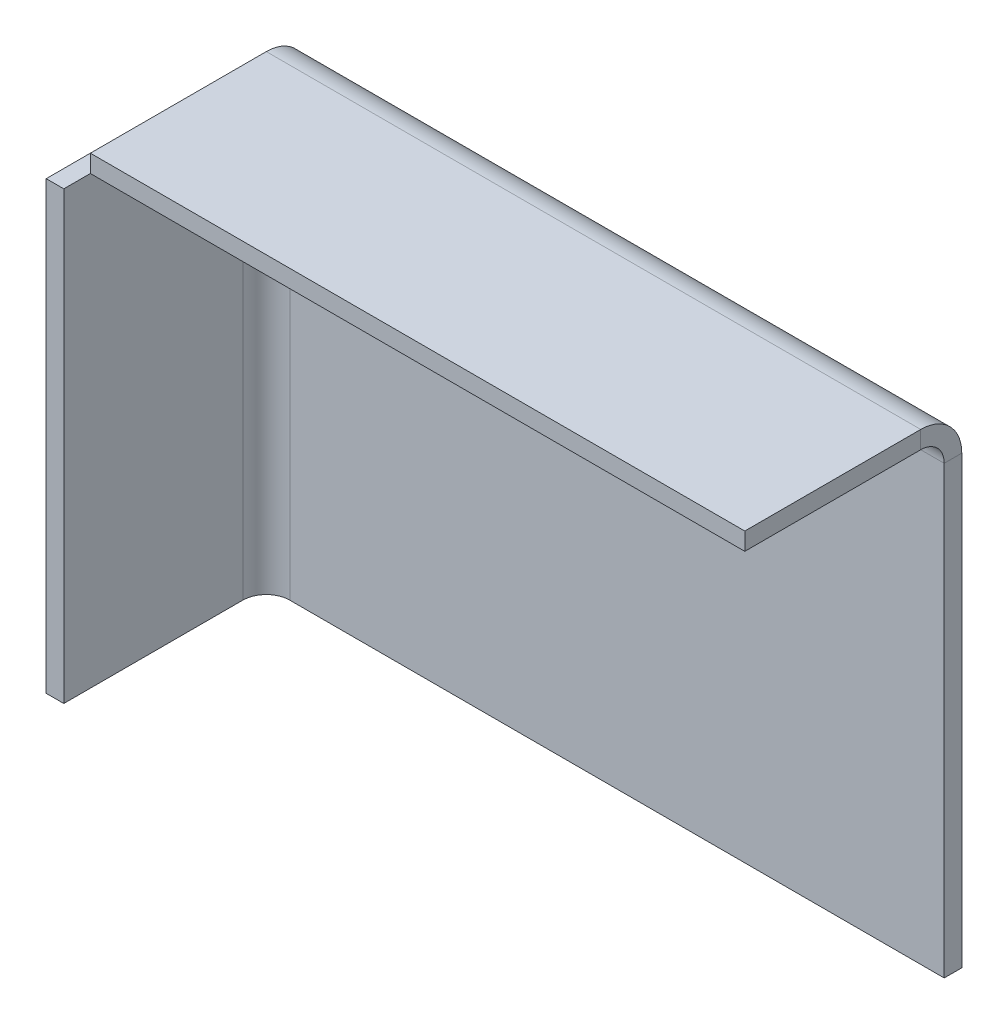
ISO-10303-21;
HEADER;
FILE_DESCRIPTION(('STEP AP214'),'2;1');
FILE_NAME('part.step','',(''),(''),'','','');
FILE_SCHEMA(('AUTOMOTIVE_DESIGN { 1 0 10303 214 1 1 1 1 }'));
ENDSEC;
DATA;
#1=APPLICATION_CONTEXT('core data for automotive mechanical design processes');
#2=APPLICATION_PROTOCOL_DEFINITION('international standard','automotive_design',2000,#1);
#3=PRODUCT_CONTEXT('',#1,'mechanical');
#4=PRODUCT('Part','Part','',(#3));
#5=PRODUCT_RELATED_PRODUCT_CATEGORY('part','',(#4));
#6=PRODUCT_DEFINITION_FORMATION('','',#4);
#7=PRODUCT_DEFINITION_CONTEXT('part definition',#1,'design');
#8=PRODUCT_DEFINITION('design','',#6,#7);
#9=PRODUCT_DEFINITION_SHAPE('','',#8);
#10=(LENGTH_UNIT() NAMED_UNIT(*) SI_UNIT(.MILLI.,.METRE.));
#11=(NAMED_UNIT(*) PLANE_ANGLE_UNIT() SI_UNIT($,.RADIAN.));
#12=(NAMED_UNIT(*) SI_UNIT($,.STERADIAN.) SOLID_ANGLE_UNIT());
#13=UNCERTAINTY_MEASURE_WITH_UNIT(LENGTH_MEASURE(1.E-05),#10,'distance_accuracy_value','');
#14=(GEOMETRIC_REPRESENTATION_CONTEXT(3) GLOBAL_UNCERTAINTY_ASSIGNED_CONTEXT((#13)) GLOBAL_UNIT_ASSIGNED_CONTEXT((#10,
#11,#12)) REPRESENTATION_CONTEXT('',''));
#15=CARTESIAN_POINT('',(0.,0.,0.));
#16=DIRECTION('',(0.,0.,1.));
#17=DIRECTION('',(1.,0.,0.));
#18=AXIS2_PLACEMENT_3D('',#15,#16,#17);
#19=CARTESIAN_POINT('',(0.,76.,-3.));
#20=DIRECTION('',(0.,0.,1.));
#21=DIRECTION('',(1.,0.,0.));
#22=AXIS2_PLACEMENT_3D('',#19,#20,#21);
#23=PLANE('',#22);
#24=DIRECTION('',(1.,0.,0.));
#25=VECTOR('',#24,1.);
#26=CARTESIAN_POINT('',(0.,0.,-3.));
#27=LINE('',#26,#25);
#28=CARTESIAN_POINT('',(0.,0.,-3.));
#29=VERTEX_POINT('',#28);
#30=CARTESIAN_POINT('',(-111.583658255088,0.,-3.));
#31=VERTEX_POINT('',#30);
#32=EDGE_CURVE('E253',#29,#31,#27,.F.);
#33=ORIENTED_EDGE('',*,*,#32,.T.);
#34=DIRECTION('',(0.,-1.,0.));
#35=VECTOR('',#34,1.);
#36=CARTESIAN_POINT('',(-111.583658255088,76.,-3.));
#37=LINE('',#36,#35);
#38=CARTESIAN_POINT('',(-111.583658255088,76.,-3.));
#39=VERTEX_POINT('',#38);
#40=EDGE_CURVE('E13',#39,#31,#37,.T.);
#41=ORIENTED_EDGE('',*,*,#40,.F.);
#42=DIRECTION('',(1.,0.,0.));
#43=VECTOR('',#42,1.);
#44=CARTESIAN_POINT('',(0.,76.,-3.));
#45=LINE('',#44,#43);
#46=CARTESIAN_POINT('',(0.,76.,-3.));
#47=VERTEX_POINT('',#46);
#48=EDGE_CURVE('E262',#47,#39,#45,.F.);
#49=ORIENTED_EDGE('',*,*,#48,.F.);
#50=DIRECTION('',(0.,-1.,0.));
#51=VECTOR('',#50,1.);
#52=CARTESIAN_POINT('',(0.,76.,-3.));
#53=LINE('',#52,#51);
#54=EDGE_CURVE('E88',#47,#29,#53,.T.);
#55=ORIENTED_EDGE('',*,*,#54,.T.);
#56=EDGE_LOOP('',(#33,#41,#49,#55));
#57=FACE_BOUND('',#56,.T.);
#58=ADVANCED_FACE('F72',(#57),#23,.F.);
#59=CARTESIAN_POINT('',(0.,76.,0.));
#60=DIRECTION('',(0.,0.,1.));
#61=DIRECTION('',(1.,0.,0.));
#62=AXIS2_PLACEMENT_3D('',#59,#60,#61);
#63=PLANE('',#62);
#64=DIRECTION('',(-1.,0.,0.));
#65=VECTOR('',#64,1.);
#66=CARTESIAN_POINT('',(0.,0.,0.));
#67=LINE('',#66,#65);
#68=CARTESIAN_POINT('',(0.,0.,0.));
#69=VERTEX_POINT('',#68);
#70=CARTESIAN_POINT('',(-111.583658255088,0.,0.));
#71=VERTEX_POINT('',#70);
#72=EDGE_CURVE('E275',#69,#71,#67,.T.);
#73=ORIENTED_EDGE('',*,*,#72,.F.);
#74=DIRECTION('',(0.,-1.,0.));
#75=VECTOR('',#74,1.);
#76=CARTESIAN_POINT('',(0.,76.,0.));
#77=LINE('',#76,#75);
#78=CARTESIAN_POINT('',(0.,76.,0.));
#79=VERTEX_POINT('',#78);
#80=EDGE_CURVE('E100',#79,#69,#77,.T.);
#81=ORIENTED_EDGE('',*,*,#80,.F.);
#82=DIRECTION('',(-1.,0.,0.));
#83=VECTOR('',#82,1.);
#84=CARTESIAN_POINT('',(0.,76.,0.));
#85=LINE('',#84,#83);
#86=CARTESIAN_POINT('',(-111.583658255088,76.,0.));
#87=VERTEX_POINT('',#86);
#88=EDGE_CURVE('E108',#79,#87,#85,.T.);
#89=ORIENTED_EDGE('',*,*,#88,.T.);
#90=DIRECTION('',(0.,-1.,0.));
#91=VECTOR('',#90,1.);
#92=CARTESIAN_POINT('',(-111.583658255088,76.,0.));
#93=LINE('',#92,#91);
#94=EDGE_CURVE('E80',#87,#71,#93,.T.);
#95=ORIENTED_EDGE('',*,*,#94,.T.);
#96=EDGE_LOOP('',(#73,#81,#89,#95));
#97=FACE_BOUND('',#96,.T.);
#98=ADVANCED_FACE('F282',(#97),#63,.T.);
#99=CARTESIAN_POINT('',(0.,76.,-3.));
#100=DIRECTION('',(1.,0.,0.));
#101=DIRECTION('',(0.,0.,-1.));
#102=AXIS2_PLACEMENT_3D('',#99,#100,#101);
#103=PLANE('',#102);
#104=DIRECTION('',(0.,0.,1.));
#105=VECTOR('',#104,1.);
#106=CARTESIAN_POINT('',(0.,0.,-3.));
#107=LINE('',#106,#105);
#108=EDGE_CURVE('E266',#29,#69,#107,.T.);
#109=ORIENTED_EDGE('',*,*,#108,.F.);
#110=ORIENTED_EDGE('',*,*,#54,.F.);
#111=DIRECTION('',(0.,0.,1.));
#112=VECTOR('',#111,1.);
#113=CARTESIAN_POINT('',(0.,76.,-3.));
#114=LINE('',#113,#112);
#115=EDGE_CURVE('E270',#47,#79,#114,.T.);
#116=ORIENTED_EDGE('',*,*,#115,.T.);
#117=ORIENTED_EDGE('',*,*,#80,.T.);
#118=EDGE_LOOP('',(#109,#110,#116,#117));
#119=FACE_BOUND('',#118,.T.);
#120=ADVANCED_FACE('F338',(#119),#103,.T.);
#121=CARTESIAN_POINT('',(-111.583658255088,0.,-3.));
#122=DIRECTION('',(0.,1.,0.));
#123=DIRECTION('',(0.,0.,1.));
#124=AXIS2_PLACEMENT_3D('',#121,#122,#123);
#125=PLANE('',#124);
#126=ORIENTED_EDGE('',*,*,#32,.F.);
#127=ORIENTED_EDGE('',*,*,#108,.T.);
#128=ORIENTED_EDGE('',*,*,#72,.T.);
#129=DIRECTION('',(0.,0.,-1.));
#130=VECTOR('',#129,1.);
#131=CARTESIAN_POINT('',(-111.583658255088,0.,0.));
#132=LINE('',#131,#130);
#133=EDGE_CURVE('E273',#71,#31,#132,.T.);
#134=ORIENTED_EDGE('',*,*,#133,.T.);
#135=EDGE_LOOP('',(#126,#127,#128,#134));
#136=FACE_BOUND('',#135,.T.);
#137=ADVANCED_FACE('F287',(#136),#125,.F.);
#138=CARTESIAN_POINT('',(0.,76.,4.));
#139=DIRECTION('',(1.,0.,0.));
#140=DIRECTION('',(0.,0.,-1.));
#141=AXIS2_PLACEMENT_3D('',#138,#139,#140);
#142=PLANE('',#141);
#143=DIRECTION('',(0.,-1.,0.));
#144=VECTOR('',#143,1.);
#145=CARTESIAN_POINT('',(0.,83.,3.99999999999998));
#146=LINE('',#145,#144);
#147=CARTESIAN_POINT('',(0.,80.,3.99999999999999));
#148=VERTEX_POINT('',#147);
#149=CARTESIAN_POINT('',(0.,83.,3.99999999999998));
#150=VERTEX_POINT('',#149);
#151=EDGE_CURVE('E210',#148,#150,#146,.F.);
#152=ORIENTED_EDGE('',*,*,#151,.F.);
#153=CARTESIAN_POINT('',(0.,76.,4.));
#154=DIRECTION('',(-1.,0.,0.));
#155=DIRECTION('',(0.,0.,1.));
#156=AXIS2_PLACEMENT_3D('',#153,#154,#155);
#157=CIRCLE('',#156,4.);
#158=EDGE_CURVE('E257',#79,#148,#157,.F.);
#159=ORIENTED_EDGE('',*,*,#158,.F.);
#160=ORIENTED_EDGE('',*,*,#115,.F.);
#161=CARTESIAN_POINT('',(0.,76.,4.));
#162=DIRECTION('',(-1.,0.,0.));
#163=DIRECTION('',(0.,0.,1.));
#164=AXIS2_PLACEMENT_3D('',#161,#162,#163);
#165=CIRCLE('',#164,7.);
#166=EDGE_CURVE('E250',#47,#150,#165,.F.);
#167=ORIENTED_EDGE('',*,*,#166,.T.);
#168=EDGE_LOOP('',(#152,#159,#160,#167));
#169=FACE_BOUND('',#168,.T.);
#170=ADVANCED_FACE('F337',(#169),#142,.T.);
#171=CARTESIAN_POINT('',(-111.583658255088,76.,4.));
#172=DIRECTION('',(1.,0.,0.));
#173=DIRECTION('',(0.,0.,-1.));
#174=AXIS2_PLACEMENT_3D('',#171,#172,#173);
#175=PLANE('',#174);
#176=CARTESIAN_POINT('',(-111.583658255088,76.,4.));
#177=DIRECTION('',(-1.,0.,0.));
#178=DIRECTION('',(0.,0.,1.));
#179=AXIS2_PLACEMENT_3D('',#176,#177,#178);
#180=CIRCLE('',#179,4.);
#181=CARTESIAN_POINT('',(-111.583658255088,80.,3.99999999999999));
#182=VERTEX_POINT('',#181);
#183=EDGE_CURVE('E223',#182,#87,#180,.T.);
#184=ORIENTED_EDGE('',*,*,#183,.F.);
#185=DIRECTION('',(0.,-1.,0.));
#186=VECTOR('',#185,1.);
#187=CARTESIAN_POINT('',(-111.583658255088,80.,3.99999999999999));
#188=LINE('',#187,#186);
#189=CARTESIAN_POINT('',(-111.583658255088,83.,3.99999999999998));
#190=VERTEX_POINT('',#189);
#191=EDGE_CURVE('E243',#182,#190,#188,.F.);
#192=ORIENTED_EDGE('',*,*,#191,.T.);
#193=CARTESIAN_POINT('',(-111.583658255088,76.,4.));
#194=DIRECTION('',(-1.,0.,0.));
#195=DIRECTION('',(0.,0.,1.));
#196=AXIS2_PLACEMENT_3D('',#193,#194,#195);
#197=CIRCLE('',#196,7.);
#198=EDGE_CURVE('E254',#190,#39,#197,.T.);
#199=ORIENTED_EDGE('',*,*,#198,.T.);
#200=DIRECTION('',(0.,0.,-1.));
#201=VECTOR('',#200,1.);
#202=CARTESIAN_POINT('',(-111.583658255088,76.,0.));
#203=LINE('',#202,#201);
#204=EDGE_CURVE('E265',#87,#39,#203,.T.);
#205=ORIENTED_EDGE('',*,*,#204,.F.);
#206=EDGE_LOOP('',(#184,#192,#199,#205));
#207=FACE_BOUND('',#206,.T.);
#208=ADVANCED_FACE('F307',(#207),#175,.F.);
#209=CARTESIAN_POINT('',(-111.583658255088,76.,4.));
#210=DIRECTION('',(-1.,0.,0.));
#211=DIRECTION('',(0.,1.,0.));
#212=AXIS2_PLACEMENT_3D('',#209,#210,#211);
#213=CYLINDRICAL_SURFACE('',#212,7.);
#214=ORIENTED_EDGE('',*,*,#48,.T.);
#215=ORIENTED_EDGE('',*,*,#198,.F.);
#216=DIRECTION('',(-1.,0.,0.));
#217=VECTOR('',#216,1.);
#218=CARTESIAN_POINT('',(0.,83.,3.99999999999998));
#219=LINE('',#218,#217);
#220=EDGE_CURVE('E241',#190,#150,#219,.F.);
#221=ORIENTED_EDGE('',*,*,#220,.T.);
#222=ORIENTED_EDGE('',*,*,#166,.F.);
#223=EDGE_LOOP('',(#214,#215,#221,#222));
#224=FACE_BOUND('',#223,.T.);
#225=ADVANCED_FACE('F334',(#224),#213,.T.);
#226=CARTESIAN_POINT('',(-111.583658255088,76.,4.));
#227=DIRECTION('',(-1.,0.,0.));
#228=DIRECTION('',(0.,1.,0.));
#229=AXIS2_PLACEMENT_3D('',#226,#227,#228);
#230=CYLINDRICAL_SURFACE('',#229,4.);
#231=ORIENTED_EDGE('',*,*,#88,.F.);
#232=ORIENTED_EDGE('',*,*,#158,.T.);
#233=DIRECTION('',(-1.,0.,0.));
#234=VECTOR('',#233,1.);
#235=CARTESIAN_POINT('',(0.,80.,3.99999999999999));
#236=LINE('',#235,#234);
#237=EDGE_CURVE('E246',#148,#182,#236,.T.);
#238=ORIENTED_EDGE('',*,*,#237,.T.);
#239=ORIENTED_EDGE('',*,*,#183,.T.);
#240=EDGE_LOOP('',(#231,#232,#238,#239));
#241=FACE_BOUND('',#240,.T.);
#242=ADVANCED_FACE('F310',(#241),#230,.F.);
#243=CARTESIAN_POINT('',(-111.583658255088,83.0000000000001,34.));
#244=DIRECTION('',(1.,0.,0.));
#245=DIRECTION('',(0.,0.,-1.));
#246=AXIS2_PLACEMENT_3D('',#243,#244,#245);
#247=PLANE('',#246);
#248=ORIENTED_EDGE('',*,*,#191,.F.);
#249=DIRECTION('',(0.,0.,-1.));
#250=VECTOR('',#249,1.);
#251=CARTESIAN_POINT('',(-111.583658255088,80.0000000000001,34.));
#252=LINE('',#251,#250);
#253=CARTESIAN_POINT('',(-111.583658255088,80.0000000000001,34.));
#254=VERTEX_POINT('',#253);
#255=EDGE_CURVE('E239',#182,#254,#252,.F.);
#256=ORIENTED_EDGE('',*,*,#255,.T.);
#257=DIRECTION('',(0.,-1.,0.));
#258=VECTOR('',#257,1.);
#259=CARTESIAN_POINT('',(-111.583658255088,83.0000000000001,34.));
#260=LINE('',#259,#258);
#261=CARTESIAN_POINT('',(-111.583658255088,83.0000000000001,34.));
#262=VERTEX_POINT('',#261);
#263=EDGE_CURVE('E220',#262,#254,#260,.T.);
#264=ORIENTED_EDGE('',*,*,#263,.F.);
#265=DIRECTION('',(0.,0.,1.));
#266=VECTOR('',#265,1.);
#267=CARTESIAN_POINT('',(-111.583658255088,83.,0.));
#268=LINE('',#267,#266);
#269=EDGE_CURVE('E232',#190,#262,#268,.T.);
#270=ORIENTED_EDGE('',*,*,#269,.F.);
#271=EDGE_LOOP('',(#248,#256,#264,#270));
#272=FACE_BOUND('',#271,.T.);
#273=ADVANCED_FACE('F328',(#272),#247,.F.);
#274=CARTESIAN_POINT('',(0.,83.,0.));
#275=DIRECTION('',(-1.,0.,0.));
#276=DIRECTION('',(0.,0.,1.));
#277=AXIS2_PLACEMENT_3D('',#274,#275,#276);
#278=PLANE('',#277);
#279=ORIENTED_EDGE('',*,*,#151,.T.);
#280=DIRECTION('',(0.,0.,-1.));
#281=VECTOR('',#280,1.);
#282=CARTESIAN_POINT('',(0.,83.,0.));
#283=LINE('',#282,#281);
#284=CARTESIAN_POINT('',(0.,83.0000000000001,34.));
#285=VERTEX_POINT('',#284);
#286=EDGE_CURVE('E227',#285,#150,#283,.T.);
#287=ORIENTED_EDGE('',*,*,#286,.F.);
#288=DIRECTION('',(0.,-1.,0.));
#289=VECTOR('',#288,1.);
#290=CARTESIAN_POINT('',(0.,83.0000000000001,34.));
#291=LINE('',#290,#289);
#292=CARTESIAN_POINT('',(0.,80.0000000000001,34.));
#293=VERTEX_POINT('',#292);
#294=EDGE_CURVE('E224',#285,#293,#291,.T.);
#295=ORIENTED_EDGE('',*,*,#294,.T.);
#296=DIRECTION('',(0.,0.,1.));
#297=VECTOR('',#296,1.);
#298=CARTESIAN_POINT('',(0.,80.,0.));
#299=LINE('',#298,#297);
#300=EDGE_CURVE('E234',#293,#148,#299,.F.);
#301=ORIENTED_EDGE('',*,*,#300,.T.);
#302=EDGE_LOOP('',(#279,#287,#295,#301));
#303=FACE_BOUND('',#302,.T.);
#304=ADVANCED_FACE('F319',(#303),#278,.F.);
#305=CARTESIAN_POINT('',(-111.583658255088,83.,0.));
#306=DIRECTION('',(0.,-1.,0.));
#307=DIRECTION('',(0.,0.,-1.));
#308=AXIS2_PLACEMENT_3D('',#305,#306,#307);
#309=PLANE('',#308);
#310=ORIENTED_EDGE('',*,*,#220,.F.);
#311=ORIENTED_EDGE('',*,*,#269,.T.);
#312=DIRECTION('',(1.,0.,0.));
#313=VECTOR('',#312,1.);
#314=CARTESIAN_POINT('',(-111.583658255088,83.0000000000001,34.));
#315=LINE('',#314,#313);
#316=EDGE_CURVE('E230',#262,#285,#315,.T.);
#317=ORIENTED_EDGE('',*,*,#316,.T.);
#318=ORIENTED_EDGE('',*,*,#286,.T.);
#319=EDGE_LOOP('',(#310,#311,#317,#318));
#320=FACE_BOUND('',#319,.T.);
#321=ADVANCED_FACE('F331',(#320),#309,.F.);
#322=CARTESIAN_POINT('',(-111.583658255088,80.,0.));
#323=DIRECTION('',(0.,-1.,0.));
#324=DIRECTION('',(0.,0.,-1.));
#325=AXIS2_PLACEMENT_3D('',#322,#323,#324);
#326=PLANE('',#325);
#327=ORIENTED_EDGE('',*,*,#255,.F.);
#328=ORIENTED_EDGE('',*,*,#237,.F.);
#329=ORIENTED_EDGE('',*,*,#300,.F.);
#330=DIRECTION('',(-1.,0.,0.));
#331=VECTOR('',#330,1.);
#332=CARTESIAN_POINT('',(0.,80.0000000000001,34.));
#333=LINE('',#332,#331);
#334=EDGE_CURVE('E237',#254,#293,#333,.F.);
#335=ORIENTED_EDGE('',*,*,#334,.F.);
#336=EDGE_LOOP('',(#327,#328,#329,#335));
#337=FACE_BOUND('',#336,.T.);
#338=ADVANCED_FACE('F316',(#337),#326,.T.);
#339=CARTESIAN_POINT('',(0.,83.0000000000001,34.));
#340=DIRECTION('',(0.,0.,-1.));
#341=DIRECTION('',(0.,1.,0.));
#342=AXIS2_PLACEMENT_3D('',#339,#340,#341);
#343=PLANE('',#342);
#344=ORIENTED_EDGE('',*,*,#334,.T.);
#345=ORIENTED_EDGE('',*,*,#294,.F.);
#346=ORIENTED_EDGE('',*,*,#316,.F.);
#347=ORIENTED_EDGE('',*,*,#263,.T.);
#348=EDGE_LOOP('',(#344,#345,#346,#347));
#349=FACE_BOUND('',#348,.T.);
#350=ADVANCED_FACE('F324',(#349),#343,.F.);
#351=CARTESIAN_POINT('',(-111.583658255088,76.,4.));
#352=DIRECTION('',(0.,1.,0.));
#353=DIRECTION('',(0.,0.,1.));
#354=AXIS2_PLACEMENT_3D('',#351,#352,#353);
#355=PLANE('',#354);
#356=DIRECTION('',(1.,0.,0.));
#357=VECTOR('',#356,1.);
#358=CARTESIAN_POINT('',(-118.583658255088,76.,3.99999999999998));
#359=LINE('',#358,#357);
#360=CARTESIAN_POINT('',(-115.583658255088,76.,3.99999999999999));
#361=VERTEX_POINT('',#360);
#362=CARTESIAN_POINT('',(-118.583658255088,76.,3.99999999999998));
#363=VERTEX_POINT('',#362);
#364=EDGE_CURVE('E190',#361,#363,#359,.F.);
#365=ORIENTED_EDGE('',*,*,#364,.F.);
#366=CARTESIAN_POINT('',(-111.583658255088,76.,4.));
#367=DIRECTION('',(0.,-1.,0.));
#368=DIRECTION('',(0.,0.,-1.));
#369=AXIS2_PLACEMENT_3D('',#366,#367,#368);
#370=CIRCLE('',#369,4.);
#371=EDGE_CURVE('E214',#87,#361,#370,.F.);
#372=ORIENTED_EDGE('',*,*,#371,.F.);
#373=ORIENTED_EDGE('',*,*,#204,.T.);
#374=CARTESIAN_POINT('',(-111.583658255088,76.,4.));
#375=DIRECTION('',(0.,-1.,0.));
#376=DIRECTION('',(0.,0.,-1.));
#377=AXIS2_PLACEMENT_3D('',#374,#375,#376);
#378=CIRCLE('',#377,7.);
#379=EDGE_CURVE('E207',#39,#363,#378,.F.);
#380=ORIENTED_EDGE('',*,*,#379,.T.);
#381=EDGE_LOOP('',(#365,#372,#373,#380));
#382=FACE_BOUND('',#381,.T.);
#383=ADVANCED_FACE('F304',(#382),#355,.T.);
#384=CARTESIAN_POINT('',(-111.583658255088,0.,4.));
#385=DIRECTION('',(0.,1.,0.));
#386=DIRECTION('',(0.,0.,1.));
#387=AXIS2_PLACEMENT_3D('',#384,#385,#386);
#388=PLANE('',#387);
#389=CARTESIAN_POINT('',(-111.583658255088,0.,4.));
#390=DIRECTION('',(0.,-1.,0.));
#391=DIRECTION('',(0.,0.,-1.));
#392=AXIS2_PLACEMENT_3D('',#389,#390,#391);
#393=CIRCLE('',#392,4.);
#394=CARTESIAN_POINT('',(-115.583658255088,0.,3.99999999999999));
#395=VERTEX_POINT('',#394);
#396=EDGE_CURVE('E217',#395,#71,#393,.T.);
#397=ORIENTED_EDGE('',*,*,#396,.F.);
#398=DIRECTION('',(1.,0.,0.));
#399=VECTOR('',#398,1.);
#400=CARTESIAN_POINT('',(-115.583658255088,0.,3.99999999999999));
#401=LINE('',#400,#399);
#402=CARTESIAN_POINT('',(-118.583658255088,0.,3.99999999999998));
#403=VERTEX_POINT('',#402);
#404=EDGE_CURVE('E201',#395,#403,#401,.F.);
#405=ORIENTED_EDGE('',*,*,#404,.T.);
#406=CARTESIAN_POINT('',(-111.583658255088,0.,4.));
#407=DIRECTION('',(0.,-1.,0.));
#408=DIRECTION('',(0.,0.,-1.));
#409=AXIS2_PLACEMENT_3D('',#406,#407,#408);
#410=CIRCLE('',#409,7.);
#411=EDGE_CURVE('E211',#403,#31,#410,.T.);
#412=ORIENTED_EDGE('',*,*,#411,.T.);
#413=ORIENTED_EDGE('',*,*,#133,.F.);
#414=EDGE_LOOP('',(#397,#405,#412,#413));
#415=FACE_BOUND('',#414,.T.);
#416=ADVANCED_FACE('F290',(#415),#388,.F.);
#417=CARTESIAN_POINT('',(-111.583658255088,0.,4.));
#418=DIRECTION('',(0.,-1.,0.));
#419=DIRECTION('',(-1.,0.,0.));
#420=AXIS2_PLACEMENT_3D('',#417,#418,#419);
#421=CYLINDRICAL_SURFACE('',#420,7.);
#422=ORIENTED_EDGE('',*,*,#40,.T.);
#423=ORIENTED_EDGE('',*,*,#411,.F.);
#424=DIRECTION('',(0.,-1.,0.));
#425=VECTOR('',#424,1.);
#426=CARTESIAN_POINT('',(-118.583658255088,76.,3.99999999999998));
#427=LINE('',#426,#425);
#428=EDGE_CURVE('E199',#403,#363,#427,.F.);
#429=ORIENTED_EDGE('',*,*,#428,.T.);
#430=ORIENTED_EDGE('',*,*,#379,.F.);
#431=EDGE_LOOP('',(#422,#423,#429,#430));
#432=FACE_BOUND('',#431,.T.);
#433=ADVANCED_FACE('F302',(#432),#421,.T.);
#434=CARTESIAN_POINT('',(-111.583658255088,0.,4.));
#435=DIRECTION('',(0.,-1.,0.));
#436=DIRECTION('',(-1.,0.,0.));
#437=AXIS2_PLACEMENT_3D('',#434,#435,#436);
#438=CYLINDRICAL_SURFACE('',#437,4.);
#439=ORIENTED_EDGE('',*,*,#94,.F.);
#440=ORIENTED_EDGE('',*,*,#371,.T.);
#441=DIRECTION('',(0.,-1.,0.));
#442=VECTOR('',#441,1.);
#443=CARTESIAN_POINT('',(-115.583658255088,76.,3.99999999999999));
#444=LINE('',#443,#442);
#445=EDGE_CURVE('E204',#361,#395,#444,.T.);
#446=ORIENTED_EDGE('',*,*,#445,.T.);
#447=ORIENTED_EDGE('',*,*,#396,.T.);
#448=EDGE_LOOP('',(#439,#440,#446,#447));
#449=FACE_BOUND('',#448,.T.);
#450=ADVANCED_FACE('F292',(#449),#438,.F.);
#451=CARTESIAN_POINT('',(-118.583658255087,76.,0.));
#452=DIRECTION('',(0.,-1.,0.));
#453=DIRECTION('',(0.,0.,-1.));
#454=AXIS2_PLACEMENT_3D('',#451,#452,#453);
#455=PLANE('',#454);
#456=ORIENTED_EDGE('',*,*,#364,.T.);
#457=DIRECTION('',(0.,0.,-1.));
#458=VECTOR('',#457,1.);
#459=CARTESIAN_POINT('',(-118.583658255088,76.,34.524967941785));
#460=LINE('',#459,#458);
#461=CARTESIAN_POINT('',(-118.583658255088,76.,34.524967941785));
#462=VERTEX_POINT('',#461);
#463=EDGE_CURVE('E171',#462,#363,#460,.T.);
#464=ORIENTED_EDGE('',*,*,#463,.F.);
#465=DIRECTION('',(1.,0.,0.));
#466=VECTOR('',#465,1.);
#467=CARTESIAN_POINT('',(-118.583658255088,76.,34.524967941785));
#468=LINE('',#467,#466);
#469=CARTESIAN_POINT('',(-115.583658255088,76.,34.524967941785));
#470=VERTEX_POINT('',#469);
#471=EDGE_CURVE('E177',#462,#470,#468,.T.);
#472=ORIENTED_EDGE('',*,*,#471,.T.);
#473=DIRECTION('',(0.,0.,1.));
#474=VECTOR('',#473,1.);
#475=CARTESIAN_POINT('',(-115.583658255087,76.,0.));
#476=LINE('',#475,#474);
#477=EDGE_CURVE('E197',#470,#361,#476,.F.);
#478=ORIENTED_EDGE('',*,*,#477,.T.);
#479=EDGE_LOOP('',(#456,#464,#472,#478));
#480=FACE_BOUND('',#479,.T.);
#481=ADVANCED_FACE('F189',(#480),#455,.F.);
#482=CARTESIAN_POINT('',(-118.583658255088,0.,34.524967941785));
#483=DIRECTION('',(0.,1.,0.));
#484=DIRECTION('',(0.,0.,1.));
#485=AXIS2_PLACEMENT_3D('',#482,#483,#484);
#486=PLANE('',#485);
#487=ORIENTED_EDGE('',*,*,#404,.F.);
#488=DIRECTION('',(0.,0.,-1.));
#489=VECTOR('',#488,1.);
#490=CARTESIAN_POINT('',(-115.583658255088,0.,34.524967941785));
#491=LINE('',#490,#489);
#492=CARTESIAN_POINT('',(-115.583658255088,0.,34.524967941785));
#493=VERTEX_POINT('',#492);
#494=EDGE_CURVE('E193',#395,#493,#491,.F.);
#495=ORIENTED_EDGE('',*,*,#494,.T.);
#496=DIRECTION('',(1.,0.,0.));
#497=VECTOR('',#496,1.);
#498=CARTESIAN_POINT('',(-118.583658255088,0.,34.524967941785));
#499=LINE('',#498,#497);
#500=CARTESIAN_POINT('',(-118.583658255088,0.,34.524967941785));
#501=VERTEX_POINT('',#500);
#502=EDGE_CURVE('E186',#501,#493,#499,.T.);
#503=ORIENTED_EDGE('',*,*,#502,.F.);
#504=DIRECTION('',(0.,0.,1.));
#505=VECTOR('',#504,1.);
#506=CARTESIAN_POINT('',(-118.583658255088,0.,34.524967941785));
#507=LINE('',#506,#505);
#508=EDGE_CURVE('E173',#403,#501,#507,.T.);
#509=ORIENTED_EDGE('',*,*,#508,.F.);
#510=EDGE_LOOP('',(#487,#495,#503,#509));
#511=FACE_BOUND('',#510,.T.);
#512=ADVANCED_FACE('F298',(#511),#486,.F.);
#513=CARTESIAN_POINT('',(-118.583658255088,76.,34.524967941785));
#514=DIRECTION('',(1.,0.,0.));
#515=DIRECTION('',(0.,0.,-1.));
#516=AXIS2_PLACEMENT_3D('',#513,#514,#515);
#517=PLANE('',#516);
#518=ORIENTED_EDGE('',*,*,#428,.F.);
#519=ORIENTED_EDGE('',*,*,#508,.T.);
#520=DIRECTION('',(0.,1.,0.));
#521=VECTOR('',#520,1.);
#522=CARTESIAN_POINT('',(-118.583658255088,76.,34.524967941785));
#523=LINE('',#522,#521);
#524=EDGE_CURVE('E166',#501,#462,#523,.T.);
#525=ORIENTED_EDGE('',*,*,#524,.T.);
#526=ORIENTED_EDGE('',*,*,#463,.T.);
#527=EDGE_LOOP('',(#518,#519,#525,#526));
#528=FACE_BOUND('',#527,.T.);
#529=ADVANCED_FACE('F169',(#528),#517,.F.);
#530=CARTESIAN_POINT('',(-115.583658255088,76.,34.524967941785));
#531=DIRECTION('',(1.,0.,0.));
#532=DIRECTION('',(0.,0.,-1.));
#533=AXIS2_PLACEMENT_3D('',#530,#531,#532);
#534=PLANE('',#533);
#535=ORIENTED_EDGE('',*,*,#494,.F.);
#536=ORIENTED_EDGE('',*,*,#445,.F.);
#537=ORIENTED_EDGE('',*,*,#477,.F.);
#538=DIRECTION('',(0.,-1.,0.));
#539=VECTOR('',#538,1.);
#540=CARTESIAN_POINT('',(-115.583658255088,76.,34.524967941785));
#541=LINE('',#540,#539);
#542=EDGE_CURVE('E182',#493,#470,#541,.F.);
#543=ORIENTED_EDGE('',*,*,#542,.F.);
#544=EDGE_LOOP('',(#535,#536,#537,#543));
#545=FACE_BOUND('',#544,.T.);
#546=ADVANCED_FACE('F296',(#545),#534,.T.);
#547=CARTESIAN_POINT('',(-118.583658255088,76.,34.524967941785));
#548=DIRECTION('',(0.,0.,-1.));
#549=DIRECTION('',(-1.,0.,0.));
#550=AXIS2_PLACEMENT_3D('',#547,#548,#549);
#551=PLANE('',#550);
#552=ORIENTED_EDGE('',*,*,#542,.T.);
#553=ORIENTED_EDGE('',*,*,#471,.F.);
#554=ORIENTED_EDGE('',*,*,#524,.F.);
#555=ORIENTED_EDGE('',*,*,#502,.T.);
#556=EDGE_LOOP('',(#552,#553,#554,#555));
#557=FACE_BOUND('',#556,.T.);
#558=ADVANCED_FACE('F180',(#557),#551,.F.);
#559=CLOSED_SHELL('',(#58,#98,#120,#137,#170,#208,#225,#242,#273,#304,#321,#338,#350,#383,#416,
#433,#450,#481,#512,#529,#546,#558));
#560=MANIFOLD_SOLID_BREP('B2',#559);
#561=ADVANCED_BREP_SHAPE_REPRESENTATION('',(#18,#560),#14);
#562=SHAPE_DEFINITION_REPRESENTATION(#9,#561);
ENDSEC;
END-ISO-10303-21;
